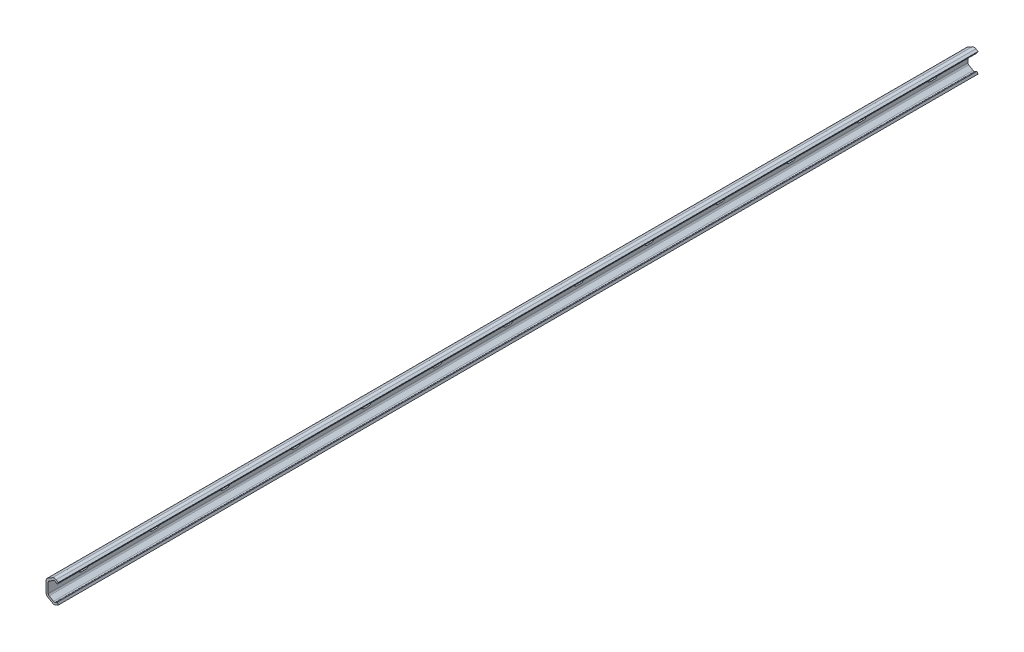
from build123d import *

# Parameters (mm, degrees)
BOSS_EXTRUDE1_DEPTH = 1040
CUT_EXTRUDE1_DEPTH  = 1041.145221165
LPATTERN1_COUNT     = 13
LPATTERN1_PITCH     = 80


with BuildPart() as part:
    # Sketch1 → Boss-Extrude1 (new body)
    with BuildSketch(Plane.XY):
        with BuildLine():
            Line((12.749875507, 8.887652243), (13.999952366, 11.052754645))
            Line((13.999952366, 11.052754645), (11.499977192, 12.496178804))
            ThreePointArc((11.499977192, 12.496178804), (9.499867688, 13.03212673), (7.499758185, 12.496178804))
            Line((7.499758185, 12.496178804), (1.999934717, 9.320716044))
            ThreePointArc((1.999934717, 9.320716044), (0.535879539, 7.85661948), (0, 5.856652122))
            Line((0, 5.856652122), (0, -5.856652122))
            ThreePointArc((0, -5.856652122), (0.535879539, -7.85661948), (1.999934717, -9.320716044))
            Line((1.999934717, -9.320716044), (7.499758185, -12.496178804))
            ThreePointArc((7.499758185, -12.496178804), (9.499867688, -13.03212673), (11.499977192, -12.496178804))
            Line((11.499977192, -12.496178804), (13.999952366, -11.052754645))
            Line((13.999952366, -11.052754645), (12.749875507, -8.887652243))
            Line((12.749875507, -8.887652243), (10.49990033, -10.186732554))
            ThreePointArc((10.49990033, -10.186732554), (9.499867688, -10.454700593), (8.499835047, -10.186732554))
            Line((8.499835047, -10.186732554), (3.500146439, -7.300035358))
            ThreePointArc((3.500146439, -7.300035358), (2.76811885, -6.567987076), (2.500179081, -5.568003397))
            Line((2.500179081, -5.568003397), (2.500179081, 0))
            Line((2.500179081, 0), (2.500179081, 5.568003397))
            ThreePointArc((2.500179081, 5.568003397), (2.76811885, 6.567987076), (3.500146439, 7.300035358))
            Line((3.500146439, 7.300035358), (8.499835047, 10.186732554))
            ThreePointArc((8.499835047, 10.186732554), (9.499867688, 10.454700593), (10.49990033, 10.186732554))
            Line((10.49990033, 10.186732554), (12.749875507, 8.887652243))
        make_face()
    extrude(amount=-BOSS_EXTRUDE1_DEPTH)

    # Sketch2 → Cut-Extrude1 (cut, through all)
    with BuildSketch(Plane(origin=(2.500179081, 0, 0), x_dir=(0, 0, -1), z_dir=(1, 0, 0))):
        with BuildLine():
            Line((37.5, 3), (42.5, 3))
            ThreePointArc((42.5, 3), (45.5, 0), (42.5, -3))
            Line((42.5, -3), (37.5, -3))
            ThreePointArc((37.5, -3), (34.5, 0), (37.5, 3))
        make_face()
    cut_extrude1 = extrude(amount=-CUT_EXTRUDE1_DEPTH, mode=Mode.SUBTRACT)

    # LPattern1: Cut-Extrude1 ×13
    with Locations(*[(0, 0, -i * LPATTERN1_PITCH) for i in range(1, LPATTERN1_COUNT)]):
        add(cut_extrude1, mode=Mode.SUBTRACT)


solid = part.part
